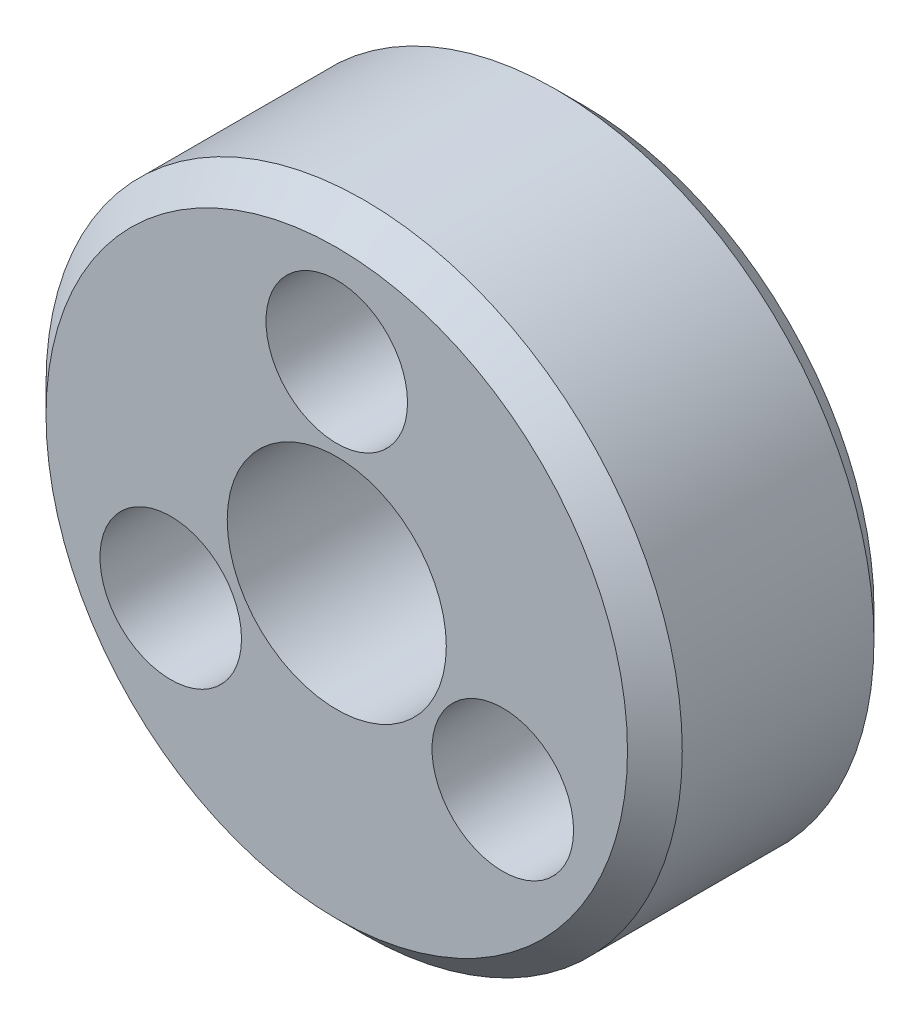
ISO-10303-21;
HEADER;
FILE_DESCRIPTION(('STEP AP214'),'2;1');
FILE_NAME('part.step','',(''),(''),'','','');
FILE_SCHEMA(('AUTOMOTIVE_DESIGN { 1 0 10303 214 1 1 1 1 }'));
ENDSEC;
DATA;
#1=APPLICATION_CONTEXT('core data for automotive mechanical design processes');
#2=APPLICATION_PROTOCOL_DEFINITION('international standard','automotive_design',2000,#1);
#3=PRODUCT_CONTEXT('',#1,'mechanical');
#4=PRODUCT('Part','Part','',(#3));
#5=PRODUCT_RELATED_PRODUCT_CATEGORY('part','',(#4));
#6=PRODUCT_DEFINITION_FORMATION('','',#4);
#7=PRODUCT_DEFINITION_CONTEXT('part definition',#1,'design');
#8=PRODUCT_DEFINITION('design','',#6,#7);
#9=PRODUCT_DEFINITION_SHAPE('','',#8);
#10=(LENGTH_UNIT() NAMED_UNIT(*) SI_UNIT(.MILLI.,.METRE.));
#11=(NAMED_UNIT(*) PLANE_ANGLE_UNIT() SI_UNIT($,.RADIAN.));
#12=(NAMED_UNIT(*) SI_UNIT($,.STERADIAN.) SOLID_ANGLE_UNIT());
#13=UNCERTAINTY_MEASURE_WITH_UNIT(LENGTH_MEASURE(1.E-05),#10,'distance_accuracy_value','');
#14=(GEOMETRIC_REPRESENTATION_CONTEXT(3) GLOBAL_UNCERTAINTY_ASSIGNED_CONTEXT((#13)) GLOBAL_UNIT_ASSIGNED_CONTEXT((#10,
#11,#12)) REPRESENTATION_CONTEXT('',''));
#15=CARTESIAN_POINT('',(0.,0.,0.));
#16=DIRECTION('',(0.,0.,1.));
#17=DIRECTION('',(1.,0.,0.));
#18=AXIS2_PLACEMENT_3D('',#15,#16,#17);
#19=CARTESIAN_POINT('',(0.,0.,7.14375));
#20=DIRECTION('',(0.,0.,-1.));
#21=DIRECTION('',(-1.,0.,0.));
#22=AXIS2_PLACEMENT_3D('',#19,#20,#21);
#23=CYLINDRICAL_SURFACE('',#22,18.4404);
#24=CARTESIAN_POINT('',(0.,0.,-5.55625));
#25=DIRECTION('',(0.,0.,1.));
#26=DIRECTION('',(1.,0.,0.));
#27=AXIS2_PLACEMENT_3D('',#24,#25,#26);
#28=CIRCLE('',#27,18.4404);
#29=CARTESIAN_POINT('',(18.4404,0.,-5.55625));
#30=VERTEX_POINT('',#29);
#31=EDGE_CURVE('E39',#30,#30,#28,.T.);
#32=ORIENTED_EDGE('',*,*,#31,.T.);
#33=EDGE_LOOP('',(#32));
#34=FACE_BOUND('',#33,.T.);
#35=CARTESIAN_POINT('',(0.,0.,5.55624999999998));
#36=DIRECTION('',(0.,0.,1.));
#37=DIRECTION('',(1.,0.,0.));
#38=AXIS2_PLACEMENT_3D('',#35,#36,#37);
#39=CIRCLE('',#38,18.4404);
#40=CARTESIAN_POINT('',(18.4404,0.,5.55624999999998));
#41=VERTEX_POINT('',#40);
#42=EDGE_CURVE('E43',#41,#41,#39,.F.);
#43=ORIENTED_EDGE('',*,*,#42,.T.);
#44=EDGE_LOOP('',(#43));
#45=FACE_BOUND('',#44,.T.);
#46=ADVANCED_FACE('F29',(#34,#45),#23,.T.);
#47=CARTESIAN_POINT('',(0.,0.,7.14375));
#48=DIRECTION('',(0.,0.,1.));
#49=DIRECTION('',(1.,0.,0.));
#50=AXIS2_PLACEMENT_3D('',#47,#48,#49);
#51=PLANE('',#50);
#52=CARTESIAN_POINT('',(0.,0.,7.14375));
#53=DIRECTION('',(0.,0.,1.));
#54=DIRECTION('',(1.,0.,0.));
#55=AXIS2_PLACEMENT_3D('',#52,#53,#54);
#56=CIRCLE('',#55,16.8529);
#57=CARTESIAN_POINT('',(16.8529,0.,7.14375));
#58=VERTEX_POINT('',#57);
#59=EDGE_CURVE('E10',#58,#58,#56,.T.);
#60=ORIENTED_EDGE('',*,*,#59,.T.);
#61=EDGE_LOOP('',(#60));
#62=FACE_BOUND('',#61,.T.);
#63=CARTESIAN_POINT('',(-9.62370729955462,-5.55624999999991,7.14375));
#64=DIRECTION('',(0.,0.,1.));
#65=DIRECTION('',(1.,0.,0.));
#66=AXIS2_PLACEMENT_3D('',#63,#64,#65);
#67=CIRCLE('',#66,4.1021);
#68=CARTESIAN_POINT('',(-5.52160729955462,-5.55624999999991,7.14375));
#69=VERTEX_POINT('',#68);
#70=EDGE_CURVE('E87',#69,#69,#67,.T.);
#71=ORIENTED_EDGE('',*,*,#70,.F.);
#72=EDGE_LOOP('',(#71));
#73=FACE_BOUND('',#72,.T.);
#74=CARTESIAN_POINT('',(9.62370729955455,-5.55625000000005,7.14375));
#75=DIRECTION('',(0.,0.,1.));
#76=DIRECTION('',(1.,0.,0.));
#77=AXIS2_PLACEMENT_3D('',#74,#75,#76);
#78=CIRCLE('',#77,4.1021);
#79=CARTESIAN_POINT('',(13.7258072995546,-5.55625000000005,7.14375));
#80=VERTEX_POINT('',#79);
#81=EDGE_CURVE('E75',#80,#80,#78,.T.);
#82=ORIENTED_EDGE('',*,*,#81,.F.);
#83=EDGE_LOOP('',(#82));
#84=FACE_BOUND('',#83,.T.);
#85=CARTESIAN_POINT('',(0.,11.1125,7.14375));
#86=DIRECTION('',(0.,0.,1.));
#87=DIRECTION('',(1.,0.,0.));
#88=AXIS2_PLACEMENT_3D('',#85,#86,#87);
#89=CIRCLE('',#88,4.1021);
#90=CARTESIAN_POINT('',(4.1021,11.1125,7.14375));
#91=VERTEX_POINT('',#90);
#92=EDGE_CURVE('E63',#91,#91,#89,.T.);
#93=ORIENTED_EDGE('',*,*,#92,.F.);
#94=EDGE_LOOP('',(#93));
#95=FACE_BOUND('',#94,.T.);
#96=CARTESIAN_POINT('',(0.,0.,7.14375));
#97=DIRECTION('',(0.,0.,1.));
#98=DIRECTION('',(1.,0.,0.));
#99=AXIS2_PLACEMENT_3D('',#96,#97,#98);
#100=CIRCLE('',#99,6.35000000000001);
#101=CARTESIAN_POINT('',(6.35000000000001,0.,7.14375));
#102=VERTEX_POINT('',#101);
#103=EDGE_CURVE('E51',#102,#102,#100,.T.);
#104=ORIENTED_EDGE('',*,*,#103,.F.);
#105=EDGE_LOOP('',(#104));
#106=FACE_BOUND('',#105,.T.);
#107=ADVANCED_FACE('F93',(#62,#73,#84,#95,#106),#51,.T.);
#108=CARTESIAN_POINT('',(0.,0.,-7.14375));
#109=DIRECTION('',(0.,0.,1.));
#110=DIRECTION('',(1.,0.,0.));
#111=AXIS2_PLACEMENT_3D('',#108,#109,#110);
#112=PLANE('',#111);
#113=CARTESIAN_POINT('',(0.,0.,-7.14375));
#114=DIRECTION('',(0.,0.,1.));
#115=DIRECTION('',(1.,0.,0.));
#116=AXIS2_PLACEMENT_3D('',#113,#114,#115);
#117=CIRCLE('',#116,16.8529);
#118=CARTESIAN_POINT('',(16.8529,0.,-7.14375));
#119=VERTEX_POINT('',#118);
#120=EDGE_CURVE('E35',#119,#119,#117,.F.);
#121=ORIENTED_EDGE('',*,*,#120,.T.);
#122=EDGE_LOOP('',(#121));
#123=FACE_BOUND('',#122,.T.);
#124=CARTESIAN_POINT('',(-9.62370729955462,-5.55624999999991,-7.14375));
#125=DIRECTION('',(0.,0.,1.));
#126=DIRECTION('',(1.,0.,0.));
#127=AXIS2_PLACEMENT_3D('',#124,#125,#126);
#128=CIRCLE('',#127,1.89865);
#129=CARTESIAN_POINT('',(-7.72505729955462,-5.55624999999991,-7.14375));
#130=VERTEX_POINT('',#129);
#131=EDGE_CURVE('E78',#130,#130,#128,.T.);
#132=ORIENTED_EDGE('',*,*,#131,.T.);
#133=EDGE_LOOP('',(#132));
#134=FACE_BOUND('',#133,.T.);
#135=CARTESIAN_POINT('',(9.62370729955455,-5.55625000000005,-7.14375));
#136=DIRECTION('',(0.,0.,1.));
#137=DIRECTION('',(1.,0.,0.));
#138=AXIS2_PLACEMENT_3D('',#135,#136,#137);
#139=CIRCLE('',#138,1.89865);
#140=CARTESIAN_POINT('',(11.5223572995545,-5.55625000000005,-7.14375));
#141=VERTEX_POINT('',#140);
#142=EDGE_CURVE('E66',#141,#141,#139,.T.);
#143=ORIENTED_EDGE('',*,*,#142,.T.);
#144=EDGE_LOOP('',(#143));
#145=FACE_BOUND('',#144,.T.);
#146=CARTESIAN_POINT('',(0.,11.1125,-7.14375));
#147=DIRECTION('',(0.,0.,1.));
#148=DIRECTION('',(1.,0.,0.));
#149=AXIS2_PLACEMENT_3D('',#146,#147,#148);
#150=CIRCLE('',#149,1.89865);
#151=CARTESIAN_POINT('',(1.89865,11.1125,-7.14375));
#152=VERTEX_POINT('',#151);
#153=EDGE_CURVE('E54',#152,#152,#150,.T.);
#154=ORIENTED_EDGE('',*,*,#153,.T.);
#155=EDGE_LOOP('',(#154));
#156=FACE_BOUND('',#155,.T.);
#157=CARTESIAN_POINT('',(0.,0.,-7.14375));
#158=DIRECTION('',(0.,0.,1.));
#159=DIRECTION('',(1.,0.,0.));
#160=AXIS2_PLACEMENT_3D('',#157,#158,#159);
#161=CIRCLE('',#160,6.35000000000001);
#162=CARTESIAN_POINT('',(6.35000000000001,0.,-7.14375));
#163=VERTEX_POINT('',#162);
#164=EDGE_CURVE('E48',#163,#163,#161,.T.);
#165=ORIENTED_EDGE('',*,*,#164,.T.);
#166=EDGE_LOOP('',(#165));
#167=FACE_BOUND('',#166,.T.);
#168=ADVANCED_FACE('F96',(#123,#134,#145,#156,#167),#112,.F.);
#169=CARTESIAN_POINT('',(0.,0.,7.14375));
#170=DIRECTION('',(0.,0.,1.));
#171=DIRECTION('',(1.,0.,0.));
#172=AXIS2_PLACEMENT_3D('',#169,#170,#171);
#173=CYLINDRICAL_SURFACE('',#172,6.35000000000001);
#174=ORIENTED_EDGE('',*,*,#164,.F.);
#175=EDGE_LOOP('',(#174));
#176=FACE_BOUND('',#175,.T.);
#177=ORIENTED_EDGE('',*,*,#103,.T.);
#178=EDGE_LOOP('',(#177));
#179=FACE_BOUND('',#178,.T.);
#180=ADVANCED_FACE('F103',(#176,#179),#173,.F.);
#181=CARTESIAN_POINT('',(0.,11.1125,7.14375));
#182=DIRECTION('',(0.,0.,1.));
#183=DIRECTION('',(1.,0.,0.));
#184=AXIS2_PLACEMENT_3D('',#181,#182,#183);
#185=CYLINDRICAL_SURFACE('',#184,1.89865);
#186=ORIENTED_EDGE('',*,*,#153,.F.);
#187=EDGE_LOOP('',(#186));
#188=FACE_BOUND('',#187,.T.);
#189=CARTESIAN_POINT('',(0.,11.1125,0.79375));
#190=DIRECTION('',(0.,0.,1.));
#191=DIRECTION('',(1.,0.,0.));
#192=AXIS2_PLACEMENT_3D('',#189,#190,#191);
#193=CIRCLE('',#192,1.89865);
#194=CARTESIAN_POINT('',(1.89865,11.1125,0.79375));
#195=VERTEX_POINT('',#194);
#196=EDGE_CURVE('E57',#195,#195,#193,.T.);
#197=ORIENTED_EDGE('',*,*,#196,.T.);
#198=EDGE_LOOP('',(#197));
#199=FACE_BOUND('',#198,.T.);
#200=ADVANCED_FACE('F105',(#188,#199),#185,.F.);
#201=CARTESIAN_POINT('',(1.89865,11.1125,0.79375));
#202=DIRECTION('',(0.,0.,-1.));
#203=DIRECTION('',(-1.,0.,0.));
#204=AXIS2_PLACEMENT_3D('',#201,#202,#203);
#205=PLANE('',#204);
#206=ORIENTED_EDGE('',*,*,#196,.F.);
#207=EDGE_LOOP('',(#206));
#208=FACE_BOUND('',#207,.T.);
#209=CARTESIAN_POINT('',(0.,11.1125,0.79375));
#210=DIRECTION('',(0.,0.,1.));
#211=DIRECTION('',(1.,0.,0.));
#212=AXIS2_PLACEMENT_3D('',#209,#210,#211);
#213=CIRCLE('',#212,4.1021);
#214=CARTESIAN_POINT('',(4.1021,11.1125,0.79375));
#215=VERTEX_POINT('',#214);
#216=EDGE_CURVE('E60',#215,#215,#213,.T.);
#217=ORIENTED_EDGE('',*,*,#216,.T.);
#218=EDGE_LOOP('',(#217));
#219=FACE_BOUND('',#218,.T.);
#220=ADVANCED_FACE('F112',(#208,#219),#205,.F.);
#221=CARTESIAN_POINT('',(0.,11.1125,7.14375));
#222=DIRECTION('',(0.,0.,1.));
#223=DIRECTION('',(1.,0.,0.));
#224=AXIS2_PLACEMENT_3D('',#221,#222,#223);
#225=CYLINDRICAL_SURFACE('',#224,4.1021);
#226=ORIENTED_EDGE('',*,*,#216,.F.);
#227=EDGE_LOOP('',(#226));
#228=FACE_BOUND('',#227,.T.);
#229=ORIENTED_EDGE('',*,*,#92,.T.);
#230=EDGE_LOOP('',(#229));
#231=FACE_BOUND('',#230,.T.);
#232=ADVANCED_FACE('F158',(#228,#231),#225,.F.);
#233=CARTESIAN_POINT('',(9.62370729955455,-5.55625000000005,7.14375));
#234=DIRECTION('',(0.,0.,1.));
#235=DIRECTION('',(1.,0.,0.));
#236=AXIS2_PLACEMENT_3D('',#233,#234,#235);
#237=CYLINDRICAL_SURFACE('',#236,1.89865);
#238=ORIENTED_EDGE('',*,*,#142,.F.);
#239=EDGE_LOOP('',(#238));
#240=FACE_BOUND('',#239,.T.);
#241=CARTESIAN_POINT('',(9.62370729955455,-5.55625000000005,0.79375));
#242=DIRECTION('',(0.,0.,1.));
#243=DIRECTION('',(1.,0.,0.));
#244=AXIS2_PLACEMENT_3D('',#241,#242,#243);
#245=CIRCLE('',#244,1.89865);
#246=CARTESIAN_POINT('',(11.5223572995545,-5.55625000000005,0.79375));
#247=VERTEX_POINT('',#246);
#248=EDGE_CURVE('E69',#247,#247,#245,.T.);
#249=ORIENTED_EDGE('',*,*,#248,.T.);
#250=EDGE_LOOP('',(#249));
#251=FACE_BOUND('',#250,.T.);
#252=ADVANCED_FACE('F154',(#240,#251),#237,.F.);
#253=CARTESIAN_POINT('',(11.5223572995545,-5.55625000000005,0.79375));
#254=DIRECTION('',(0.,0.,-1.));
#255=DIRECTION('',(-1.,0.,0.));
#256=AXIS2_PLACEMENT_3D('',#253,#254,#255);
#257=PLANE('',#256);
#258=ORIENTED_EDGE('',*,*,#248,.F.);
#259=EDGE_LOOP('',(#258));
#260=FACE_BOUND('',#259,.T.);
#261=CARTESIAN_POINT('',(9.62370729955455,-5.55625000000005,0.79375));
#262=DIRECTION('',(0.,0.,1.));
#263=DIRECTION('',(1.,0.,0.));
#264=AXIS2_PLACEMENT_3D('',#261,#262,#263);
#265=CIRCLE('',#264,4.1021);
#266=CARTESIAN_POINT('',(13.7258072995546,-5.55625000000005,0.79375));
#267=VERTEX_POINT('',#266);
#268=EDGE_CURVE('E72',#267,#267,#265,.T.);
#269=ORIENTED_EDGE('',*,*,#268,.T.);
#270=EDGE_LOOP('',(#269));
#271=FACE_BOUND('',#270,.T.);
#272=ADVANCED_FACE('F150',(#260,#271),#257,.F.);
#273=CARTESIAN_POINT('',(9.62370729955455,-5.55625000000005,7.14375));
#274=DIRECTION('',(0.,0.,1.));
#275=DIRECTION('',(1.,0.,0.));
#276=AXIS2_PLACEMENT_3D('',#273,#274,#275);
#277=CYLINDRICAL_SURFACE('',#276,4.1021);
#278=ORIENTED_EDGE('',*,*,#268,.F.);
#279=EDGE_LOOP('',(#278));
#280=FACE_BOUND('',#279,.T.);
#281=ORIENTED_EDGE('',*,*,#81,.T.);
#282=EDGE_LOOP('',(#281));
#283=FACE_BOUND('',#282,.T.);
#284=ADVANCED_FACE('F146',(#280,#283),#277,.F.);
#285=CARTESIAN_POINT('',(-9.62370729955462,-5.55624999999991,7.14375));
#286=DIRECTION('',(0.,0.,1.));
#287=DIRECTION('',(1.,0.,0.));
#288=AXIS2_PLACEMENT_3D('',#285,#286,#287);
#289=CYLINDRICAL_SURFACE('',#288,1.89865);
#290=ORIENTED_EDGE('',*,*,#131,.F.);
#291=EDGE_LOOP('',(#290));
#292=FACE_BOUND('',#291,.T.);
#293=CARTESIAN_POINT('',(-9.62370729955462,-5.55624999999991,0.79375));
#294=DIRECTION('',(0.,0.,1.));
#295=DIRECTION('',(1.,0.,0.));
#296=AXIS2_PLACEMENT_3D('',#293,#294,#295);
#297=CIRCLE('',#296,1.89865);
#298=CARTESIAN_POINT('',(-7.72505729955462,-5.55624999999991,0.79375));
#299=VERTEX_POINT('',#298);
#300=EDGE_CURVE('E81',#299,#299,#297,.T.);
#301=ORIENTED_EDGE('',*,*,#300,.T.);
#302=EDGE_LOOP('',(#301));
#303=FACE_BOUND('',#302,.T.);
#304=ADVANCED_FACE('F142',(#292,#303),#289,.F.);
#305=CARTESIAN_POINT('',(-7.72505729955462,-5.55624999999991,0.79375));
#306=DIRECTION('',(0.,0.,-1.));
#307=DIRECTION('',(-1.,0.,0.));
#308=AXIS2_PLACEMENT_3D('',#305,#306,#307);
#309=PLANE('',#308);
#310=ORIENTED_EDGE('',*,*,#300,.F.);
#311=EDGE_LOOP('',(#310));
#312=FACE_BOUND('',#311,.T.);
#313=CARTESIAN_POINT('',(-9.62370729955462,-5.55624999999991,0.79375));
#314=DIRECTION('',(0.,0.,1.));
#315=DIRECTION('',(1.,0.,0.));
#316=AXIS2_PLACEMENT_3D('',#313,#314,#315);
#317=CIRCLE('',#316,4.1021);
#318=CARTESIAN_POINT('',(-5.52160729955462,-5.55624999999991,0.79375));
#319=VERTEX_POINT('',#318);
#320=EDGE_CURVE('E84',#319,#319,#317,.T.);
#321=ORIENTED_EDGE('',*,*,#320,.T.);
#322=EDGE_LOOP('',(#321));
#323=FACE_BOUND('',#322,.T.);
#324=ADVANCED_FACE('F138',(#312,#323),#309,.F.);
#325=CARTESIAN_POINT('',(-9.62370729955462,-5.55624999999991,7.14375));
#326=DIRECTION('',(0.,0.,1.));
#327=DIRECTION('',(1.,0.,0.));
#328=AXIS2_PLACEMENT_3D('',#325,#326,#327);
#329=CYLINDRICAL_SURFACE('',#328,4.1021);
#330=ORIENTED_EDGE('',*,*,#320,.F.);
#331=EDGE_LOOP('',(#330));
#332=FACE_BOUND('',#331,.T.);
#333=ORIENTED_EDGE('',*,*,#70,.T.);
#334=EDGE_LOOP('',(#333));
#335=FACE_BOUND('',#334,.T.);
#336=ADVANCED_FACE('F91',(#332,#335),#329,.F.);
#337=CARTESIAN_POINT('',(0.,0.,-5.55625));
#338=DIRECTION('',(0.,0.,1.));
#339=DIRECTION('',(1.,0.,0.));
#340=AXIS2_PLACEMENT_3D('',#337,#338,#339);
#341=CONICAL_SURFACE('',#340,18.4404,0.78539816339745);
#342=ORIENTED_EDGE('',*,*,#120,.F.);
#343=EDGE_LOOP('',(#342));
#344=FACE_BOUND('',#343,.T.);
#345=ORIENTED_EDGE('',*,*,#31,.F.);
#346=EDGE_LOOP('',(#345));
#347=FACE_BOUND('',#346,.T.);
#348=ADVANCED_FACE('F128',(#344,#347),#341,.T.);
#349=CARTESIAN_POINT('',(0.,0.,7.14375));
#350=DIRECTION('',(0.,0.,-1.));
#351=DIRECTION('',(-1.,0.,0.));
#352=AXIS2_PLACEMENT_3D('',#349,#350,#351);
#353=CONICAL_SURFACE('',#352,16.8529,0.785398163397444);
#354=ORIENTED_EDGE('',*,*,#42,.F.);
#355=EDGE_LOOP('',(#354));
#356=FACE_BOUND('',#355,.T.);
#357=ORIENTED_EDGE('',*,*,#59,.F.);
#358=EDGE_LOOP('',(#357));
#359=FACE_BOUND('',#358,.T.);
#360=ADVANCED_FACE('F125',(#356,#359),#353,.T.);
#361=CLOSED_SHELL('',(#46,#107,#168,#180,#200,#220,#232,#252,#272,#284,#304,#324,#336,#348,#360));
#362=MANIFOLD_SOLID_BREP('B2',#361);
#363=ADVANCED_BREP_SHAPE_REPRESENTATION('',(#18,#362),#14);
#364=SHAPE_DEFINITION_REPRESENTATION(#9,#363);
ENDSEC;
END-ISO-10303-21;
